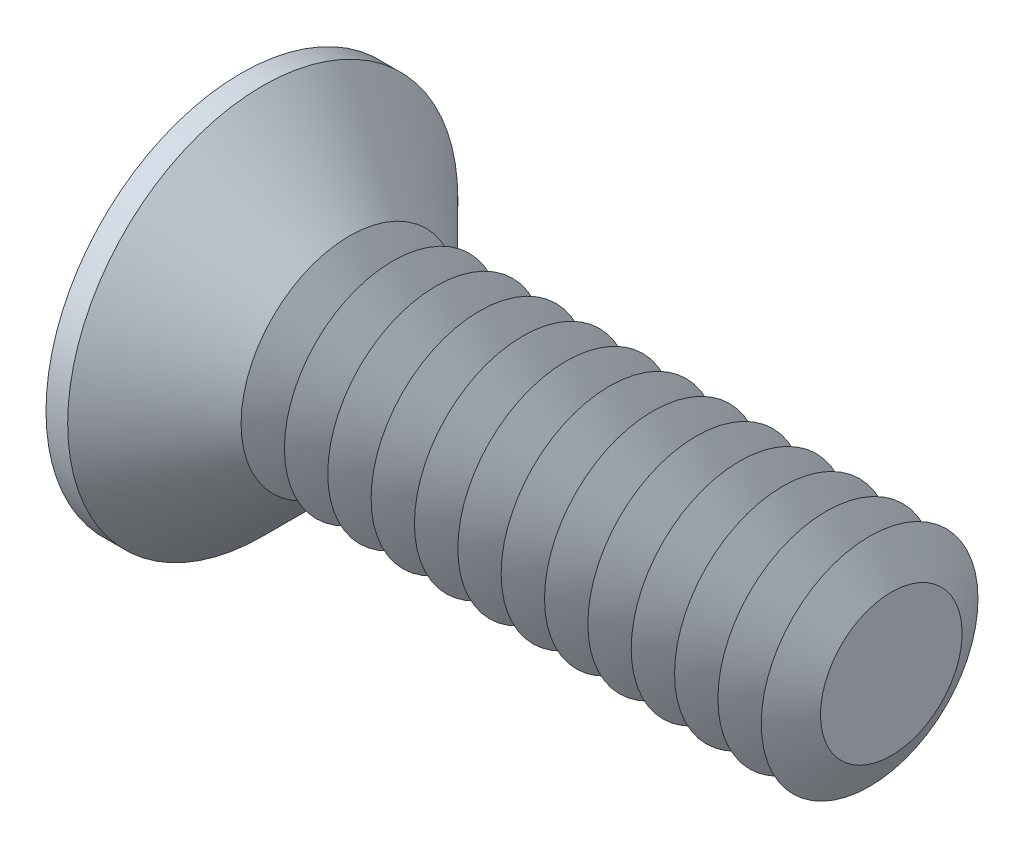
from build123d import *

# Parameters (mm, degrees)
LPATTERN1_COUNT       = 13
LPATTERN1_PITCH       = 0.4
HALFSLOT_DEPTH        = 0.24
F_4SLOTSPATTERN_COUNT = 4
F_4CORNERROUNDS_R     = 0.24


with BuildPart() as part:
    # Sketch1 → M2-.4x6FHPhillips (revolve)
    with BuildSketch(Plane.XY, mode=Mode.PRIVATE) as m2_4x6fhphillips_sk:
        Polygon((-0.8, 1.8), (0, 1), (5, 1), (5, 0), (-1, 0), (-1, 1.8), align=None)
    revolve(m2_4x6fhphillips_sk.sketch.rotate(Axis((-1, 0, 0), (1, 0, 0)), 90), axis=Axis((-1, 0, 0), (1, 0, 0)))

    # Sketch2 → Thread (revolve, cut)
    with BuildSketch(Plane.XY, mode=Mode.PRIVATE) as thread_sk:
        Polygon((4.8, 1), (5, 0.653589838), (5.2, 1), align=None)
    thread = revolve(thread_sk.sketch.rotate(Axis((0, 0, 0), (1, 0, 0)), 90), axis=Axis((0, 0, 0), (1, 0, 0)), mode=Mode.SUBTRACT)

    # LPattern1: Thread ×13
    with Locations(*[(-i * LPATTERN1_PITCH, 0, 0) for i in range(1, LPATTERN1_COUNT)]):
        add(thread, mode=Mode.SUBTRACT)

    # Sketch3 → HalfSlot (cut)
    with BuildSketch(Plane.XY):
        with BuildLine():
            Line((-1, 1.2), (-0.355766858, 1.02737825))
            ThreePointArc((-0.355766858, 1.02737825), (-0.099190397, 0.855939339), (0, 0.563733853))
            Line((0, 0.563733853), (0, -0.563733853))
            ThreePointArc((0, -0.563733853), (-0.099190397, -0.855939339), (-0.355766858, -1.02737825))
            Line((-0.355766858, -1.02737825), (-1, -1.2))
            Line((-1, -1.2), (-1, 1.2))
        make_face()
    halfslot = extrude(amount=-HALFSLOT_DEPTH, mode=Mode.SUBTRACT)

    # 4SlotsPattern: HalfSlot ×4 about axis
    f_4slotspattern_axis = Axis((-2.099825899, 0, 0), (1, 0, 0))
    for i in range(1, F_4SLOTSPATTERN_COUNT):
        add(halfslot.rotate(f_4slotspattern_axis, i * 360 / F_4SLOTSPATTERN_COUNT), mode=Mode.SUBTRACT)

    # 4CornerRounds
    f_4cornerrounds_edges = [part.edges().sort_by_distance(p)[0] for p in [
        (-0.5, 0.24, -0.24),
        (-0.5, -0.24, -0.24),
        (-0.5, -0.24, 0.24),
        (-0.5, 0.24, 0.24),
    ]]
    fillet(f_4cornerrounds_edges, radius=F_4CORNERROUNDS_R)


solid = part.part
